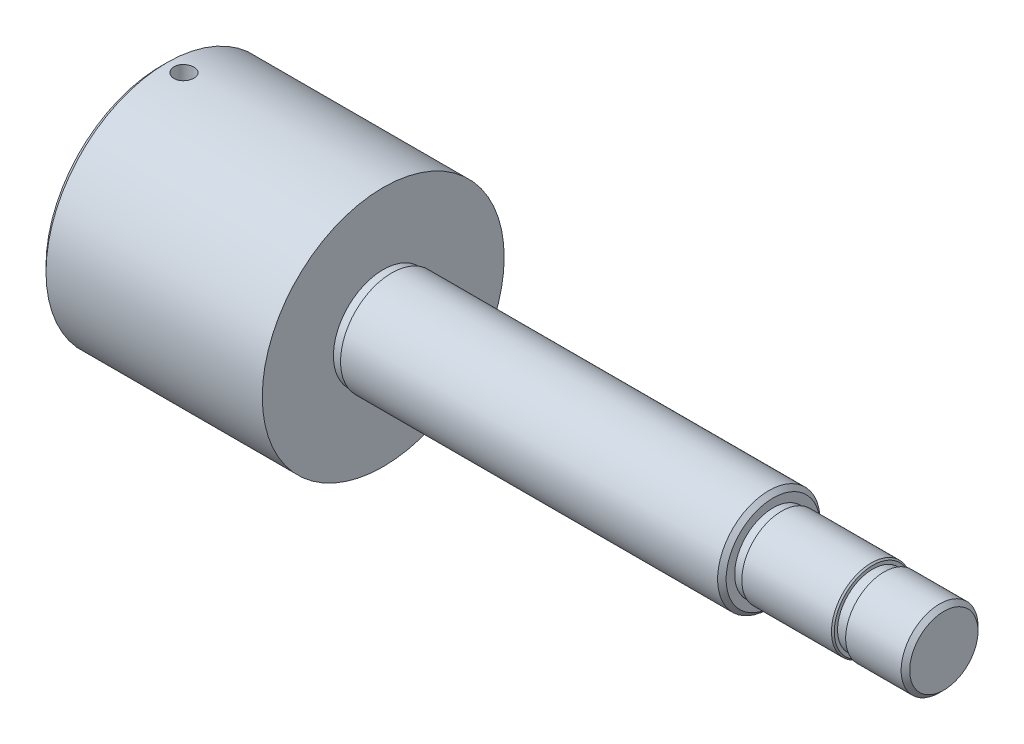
ISO-10303-21;
HEADER;
FILE_DESCRIPTION(('STEP AP214'),'2;1');
FILE_NAME('part.step','',(''),(''),'','','');
FILE_SCHEMA(('AUTOMOTIVE_DESIGN { 1 0 10303 214 1 1 1 1 }'));
ENDSEC;
DATA;
#1=APPLICATION_CONTEXT('core data for automotive mechanical design processes');
#2=APPLICATION_PROTOCOL_DEFINITION('international standard','automotive_design',2000,#1);
#3=PRODUCT_CONTEXT('',#1,'mechanical');
#4=PRODUCT('Part','Part','',(#3));
#5=PRODUCT_RELATED_PRODUCT_CATEGORY('part','',(#4));
#6=PRODUCT_DEFINITION_FORMATION('','',#4);
#7=PRODUCT_DEFINITION_CONTEXT('part definition',#1,'design');
#8=PRODUCT_DEFINITION('design','',#6,#7);
#9=PRODUCT_DEFINITION_SHAPE('','',#8);
#10=(LENGTH_UNIT() NAMED_UNIT(*) SI_UNIT(.MILLI.,.METRE.));
#11=(NAMED_UNIT(*) PLANE_ANGLE_UNIT() SI_UNIT($,.RADIAN.));
#12=(NAMED_UNIT(*) SI_UNIT($,.STERADIAN.) SOLID_ANGLE_UNIT());
#13=UNCERTAINTY_MEASURE_WITH_UNIT(LENGTH_MEASURE(1.E-05),#10,'distance_accuracy_value','');
#14=(GEOMETRIC_REPRESENTATION_CONTEXT(3) GLOBAL_UNCERTAINTY_ASSIGNED_CONTEXT((#13)) GLOBAL_UNIT_ASSIGNED_CONTEXT((#10,
#11,#12)) REPRESENTATION_CONTEXT('',''));
#15=CARTESIAN_POINT('',(0.,0.,0.));
#16=DIRECTION('',(0.,0.,1.));
#17=DIRECTION('',(1.,0.,0.));
#18=AXIS2_PLACEMENT_3D('',#15,#16,#17);
#19=CARTESIAN_POINT('',(0.,33.,0.));
#20=DIRECTION('',(-1.,0.,0.));
#21=DIRECTION('',(0.,0.,1.));
#22=AXIS2_PLACEMENT_3D('',#19,#20,#21);
#23=PLANE('',#22);
#24=CARTESIAN_POINT('',(0.,0.,0.));
#25=DIRECTION('',(-1.,0.,0.));
#26=DIRECTION('',(0.,0.,1.));
#27=AXIS2_PLACEMENT_3D('',#24,#25,#26);
#28=CIRCLE('',#27,40.5);
#29=CARTESIAN_POINT('',(0.,0.,40.5));
#30=VERTEX_POINT('',#29);
#31=EDGE_CURVE('E187',#30,#30,#28,.T.);
#32=ORIENTED_EDGE('',*,*,#31,.T.);
#33=EDGE_LOOP('',(#32));
#34=FACE_BOUND('',#33,.T.);
#35=CARTESIAN_POINT('',(0.,0.,0.));
#36=DIRECTION('',(-1.,0.,0.));
#37=DIRECTION('',(0.,0.,1.));
#38=AXIS2_PLACEMENT_3D('',#35,#36,#37);
#39=CIRCLE('',#38,35.0000000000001);
#40=CARTESIAN_POINT('',(0.,0.,35.0000000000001));
#41=VERTEX_POINT('',#40);
#42=EDGE_CURVE('E190',#41,#41,#39,.F.);
#43=ORIENTED_EDGE('',*,*,#42,.T.);
#44=EDGE_LOOP('',(#43));
#45=FACE_BOUND('',#44,.T.);
#46=ADVANCED_FACE('F39',(#34,#45),#23,.T.);
#47=CARTESIAN_POINT('',(0.,0.,0.));
#48=DIRECTION('',(1.,0.,0.));
#49=DIRECTION('',(0.,0.,-1.));
#50=AXIS2_PLACEMENT_3D('',#47,#48,#49);
#51=CYLINDRICAL_SURFACE('',#50,42.5);
#52=CARTESIAN_POINT('',(11.5,-42.5,0.));
#53=CARTESIAN_POINT('',(11.4999914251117,-42.499998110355,0.196239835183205));
#54=CARTESIAN_POINT('',(11.483440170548,-42.4986263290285,0.392613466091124));
#55=CARTESIAN_POINT('',(11.4176573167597,-42.4932859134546,0.779928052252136));
#56=CARTESIAN_POINT('',(11.368388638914,-42.4893143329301,0.970862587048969));
#57=CARTESIAN_POINT('',(11.2386048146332,-42.4792231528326,1.3416333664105));
#58=CARTESIAN_POINT('',(11.1581072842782,-42.4731047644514,1.5214758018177));
#59=CARTESIAN_POINT('',(10.9681821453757,-42.4594062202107,1.86505307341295));
#60=CARTESIAN_POINT('',(10.8587607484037,-42.4518263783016,2.02879135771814));
#61=CARTESIAN_POINT('',(10.613799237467,-42.4360344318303,2.33596377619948));
#62=CARTESIAN_POINT('',(10.4782019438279,-42.4278209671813,2.47935224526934));
#63=CARTESIAN_POINT('',(10.184858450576,-42.4116989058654,2.74136300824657));
#64=CARTESIAN_POINT('',(10.0271112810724,-42.4037903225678,2.85998421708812));
#65=CARTESIAN_POINT('',(9.69367012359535,-42.3891587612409,3.06924725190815));
#66=CARTESIAN_POINT('',(9.51795092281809,-42.3824374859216,3.15984903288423));
#67=CARTESIAN_POINT('',(9.15372948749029,-42.3709569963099,3.31024554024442));
#68=CARTESIAN_POINT('',(8.96522747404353,-42.3661977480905,3.37004079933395));
#69=CARTESIAN_POINT('',(8.58124815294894,-42.3591915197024,3.45699467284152));
#70=CARTESIAN_POINT('',(8.38578777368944,-42.3569388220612,3.48422757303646));
#71=CARTESIAN_POINT('',(7.99305833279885,-42.3551826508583,3.50551316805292));
#72=CARTESIAN_POINT('',(7.79578930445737,-42.3556791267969,3.49956647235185));
#73=CARTESIAN_POINT('',(7.40555123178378,-42.3593600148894,3.45472308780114));
#74=CARTESIAN_POINT('',(7.21257284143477,-42.3625378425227,3.41590711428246));
#75=CARTESIAN_POINT('',(6.83587956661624,-42.3712130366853,3.30655240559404));
#76=CARTESIAN_POINT('',(6.65216477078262,-42.3767104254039,3.23601336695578));
#77=CARTESIAN_POINT('',(6.29895633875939,-42.3894128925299,3.06512443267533));
#78=CARTESIAN_POINT('',(6.12948031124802,-42.3966200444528,2.9647383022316));
#79=CARTESIAN_POINT('',(5.80975278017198,-42.4119280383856,2.73703090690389));
#80=CARTESIAN_POINT('',(5.65950165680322,-42.4200288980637,2.60970910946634));
#81=CARTESIAN_POINT('',(5.38201967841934,-42.4362408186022,2.33129176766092));
#82=CARTESIAN_POINT('',(5.25485882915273,-42.44435183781,2.18012643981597));
#83=CARTESIAN_POINT('',(5.02770823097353,-42.4596471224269,1.85855658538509));
#84=CARTESIAN_POINT('',(4.92771849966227,-42.4668313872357,1.6881520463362));
#85=CARTESIAN_POINT('',(4.75775292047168,-42.4794650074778,1.33289558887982));
#86=CARTESIAN_POINT('',(4.68778014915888,-42.48491418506,1.14804219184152));
#87=CARTESIAN_POINT('',(4.57988365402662,-42.4934615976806,0.769156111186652));
#88=CARTESIAN_POINT('',(4.54195928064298,-42.4965598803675,0.575123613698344));
#89=CARTESIAN_POINT('',(4.49932383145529,-42.500050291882,0.183994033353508));
#90=CARTESIAN_POINT('',(4.49451605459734,-42.5004502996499,-0.0130924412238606));
#91=CARTESIAN_POINT('',(4.51799698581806,-42.4985201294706,-0.405268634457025));
#92=CARTESIAN_POINT('',(4.54628539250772,-42.4961899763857,-0.60035837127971));
#93=CARTESIAN_POINT('',(4.63507554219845,-42.4890666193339,-0.982727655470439));
#94=CARTESIAN_POINT('',(4.69553248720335,-42.4842768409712,-1.17001767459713));
#95=CARTESIAN_POINT('',(4.84689782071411,-42.4727723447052,-1.53179535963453));
#96=CARTESIAN_POINT('',(4.93780667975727,-42.466057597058,-1.70628282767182));
#97=CARTESIAN_POINT('',(5.14773845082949,-42.4514363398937,-2.03794256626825));
#98=CARTESIAN_POINT('',(5.26682545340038,-42.4435271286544,-2.19507414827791));
#99=CARTESIAN_POINT('',(5.52964044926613,-42.427414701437,-2.48715105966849));
#100=CARTESIAN_POINT('',(5.67336886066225,-42.4192114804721,-2.62209601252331));
#101=CARTESIAN_POINT('',(5.98180624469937,-42.403412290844,-2.86630055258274));
#102=CARTESIAN_POINT('',(6.14656525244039,-42.3958178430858,-2.975497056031));
#103=CARTESIAN_POINT('',(6.4921377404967,-42.3821174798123,-3.16467252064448));
#104=CARTESIAN_POINT('',(6.67295106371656,-42.3760115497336,-3.24465176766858));
#105=CARTESIAN_POINT('',(7.04527580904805,-42.3659880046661,-3.37301484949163));
#106=CARTESIAN_POINT('',(7.23677382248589,-42.3620677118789,-3.42143735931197));
#107=CARTESIAN_POINT('',(7.62521577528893,-42.3568502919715,-3.48543836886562));
#108=CARTESIAN_POINT('',(7.82215961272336,-42.3555531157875,-3.50101748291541));
#109=CARTESIAN_POINT('',(8.21527576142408,-42.355729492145,-3.49888244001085));
#110=CARTESIAN_POINT('',(8.41144862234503,-42.3571947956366,-3.48126740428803));
#111=CARTESIAN_POINT('',(8.79803974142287,-42.3627135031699,-3.41345071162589));
#112=CARTESIAN_POINT('',(8.98845799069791,-42.366766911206,-3.36324900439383));
#113=CARTESIAN_POINT('',(9.35814149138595,-42.3770029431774,-3.23170898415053));
#114=CARTESIAN_POINT('',(9.53740735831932,-42.3831854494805,-3.15037239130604));
#115=CARTESIAN_POINT('',(9.87975562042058,-42.3969832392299,-2.95888265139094));
#116=CARTESIAN_POINT('',(10.0428382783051,-42.4045984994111,-2.84872997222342));
#117=CARTESIAN_POINT('',(10.348697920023,-42.4204307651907,-2.60236259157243));
#118=CARTESIAN_POINT('',(10.4914157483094,-42.4286494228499,-2.46607455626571));
#119=CARTESIAN_POINT('',(10.752007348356,-42.4447473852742,-2.17143708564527));
#120=CARTESIAN_POINT('',(10.8698750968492,-42.452626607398,-2.01308231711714));
#121=CARTESIAN_POINT('',(11.0775747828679,-42.4671717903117,-1.67850814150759));
#122=CARTESIAN_POINT('',(11.1673550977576,-42.4738355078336,-1.50225661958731));
#123=CARTESIAN_POINT('',(11.3159329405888,-42.4851723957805,-1.13724643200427));
#124=CARTESIAN_POINT('',(11.3747661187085,-42.4898478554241,-0.948502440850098));
#125=CARTESIAN_POINT('',(11.4447795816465,-42.4954798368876,-0.632202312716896));
#126=CARTESIAN_POINT('',(11.4654597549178,-42.4971671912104,-0.506680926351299));
#127=CARTESIAN_POINT('',(11.493072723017,-42.4994278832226,-0.254125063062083));
#128=CARTESIAN_POINT('',(11.5000055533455,-42.5000012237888,-0.127090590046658));
#129=CARTESIAN_POINT('',(11.5,-42.5,0.));
#130=B_SPLINE_CURVE_WITH_KNOTS('',3,(#52,#53,#54,#55,#56,#57,#58,#59,#60,#61,#62,#63,#64,#65,
#66,#67,#68,#69,#70,#71,#72,#73,#74,#75,#76,#77,#78,#79,#80,#81,#82,#83,#84,#85,#86,#87,#88,#89,
#90,#91,#92,#93,#94,#95,#96,#97,#98,#99,#100,#101,#102,#103,#104,#105,#106,#107,#108,#109,#110,
#111,#112,#113,#114,#115,#116,#117,#118,#119,#120,#121,#122,#123,#124,#125,#126,#127,#128,#129),
.UNSPECIFIED.,.T.,.F.,(4,2,2,2,2,2,2,2,2,2,2,2,2,2,2,2,2,2,2,2,2,2,2,2,2,2,2,2,2,2,2,2,2,2,2,2,
2,2,4),(0.,0.5882554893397,1.17717878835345,1.76577035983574,2.35423563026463,2.94400121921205,
3.53379264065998,4.12442312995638,4.71504340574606,5.30431368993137,5.89357314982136,
6.48138977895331,7.06921203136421,7.65775084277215,8.24630129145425,8.83660736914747,
9.42691382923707,10.0172807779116,10.6076357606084,11.1962661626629,11.7848912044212,
12.3726986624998,12.9605152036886,13.5496817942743,14.1388583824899,14.7294637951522,
15.320063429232,15.909937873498,16.49980128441,17.0879060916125,17.6760118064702,
18.2640850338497,18.8521487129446,19.4418872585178,20.0317685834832,20.6227277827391,
21.2130047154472,21.5939769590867,21.9749482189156),.UNSPECIFIED.);
#131=CARTESIAN_POINT('',(11.5,-42.5,0.));
#132=VERTEX_POINT('',#131);
#133=EDGE_CURVE('E49',#132,#132,#130,.T.);
#134=ORIENTED_EDGE('',*,*,#133,.F.);
#135=EDGE_LOOP('',(#134));
#136=FACE_BOUND('',#135,.T.);
#137=CARTESIAN_POINT('',(11.5,42.5,0.));
#138=CARTESIAN_POINT('',(11.4999914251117,42.499998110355,-0.196239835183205));
#139=CARTESIAN_POINT('',(11.483440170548,42.4986263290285,-0.392613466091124));
#140=CARTESIAN_POINT('',(11.4176573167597,42.4932859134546,-0.779928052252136));
#141=CARTESIAN_POINT('',(11.368388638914,42.4893143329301,-0.970862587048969));
#142=CARTESIAN_POINT('',(11.2386048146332,42.4792231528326,-1.3416333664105));
#143=CARTESIAN_POINT('',(11.1581072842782,42.4731047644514,-1.5214758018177));
#144=CARTESIAN_POINT('',(10.9681821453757,42.4594062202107,-1.86505307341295));
#145=CARTESIAN_POINT('',(10.8587607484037,42.4518263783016,-2.02879135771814));
#146=CARTESIAN_POINT('',(10.613799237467,42.4360344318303,-2.33596377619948));
#147=CARTESIAN_POINT('',(10.4782019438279,42.4278209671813,-2.47935224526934));
#148=CARTESIAN_POINT('',(10.184858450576,42.4116989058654,-2.74136300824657));
#149=CARTESIAN_POINT('',(10.0271112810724,42.4037903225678,-2.85998421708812));
#150=CARTESIAN_POINT('',(9.69367012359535,42.3891587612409,-3.06924725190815));
#151=CARTESIAN_POINT('',(9.51795092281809,42.3824374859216,-3.15984903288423));
#152=CARTESIAN_POINT('',(9.15372948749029,42.3709569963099,-3.31024554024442));
#153=CARTESIAN_POINT('',(8.96522747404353,42.3661977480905,-3.37004079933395));
#154=CARTESIAN_POINT('',(8.58124815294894,42.3591915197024,-3.45699467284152));
#155=CARTESIAN_POINT('',(8.38578777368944,42.3569388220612,-3.48422757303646));
#156=CARTESIAN_POINT('',(7.99305833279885,42.3551826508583,-3.50551316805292));
#157=CARTESIAN_POINT('',(7.79578930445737,42.3556791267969,-3.49956647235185));
#158=CARTESIAN_POINT('',(7.40555123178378,42.3593600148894,-3.45472308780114));
#159=CARTESIAN_POINT('',(7.21257284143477,42.3625378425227,-3.41590711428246));
#160=CARTESIAN_POINT('',(6.83587956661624,42.3712130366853,-3.30655240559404));
#161=CARTESIAN_POINT('',(6.65216477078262,42.3767104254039,-3.23601336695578));
#162=CARTESIAN_POINT('',(6.29895633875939,42.3894128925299,-3.06512443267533));
#163=CARTESIAN_POINT('',(6.12948031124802,42.3966200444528,-2.9647383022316));
#164=CARTESIAN_POINT('',(5.80975278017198,42.4119280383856,-2.73703090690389));
#165=CARTESIAN_POINT('',(5.65950165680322,42.4200288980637,-2.60970910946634));
#166=CARTESIAN_POINT('',(5.38201967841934,42.4362408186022,-2.33129176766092));
#167=CARTESIAN_POINT('',(5.25485882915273,42.44435183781,-2.18012643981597));
#168=CARTESIAN_POINT('',(5.02770823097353,42.4596471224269,-1.85855658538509));
#169=CARTESIAN_POINT('',(4.92771849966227,42.4668313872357,-1.6881520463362));
#170=CARTESIAN_POINT('',(4.75775292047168,42.4794650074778,-1.33289558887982));
#171=CARTESIAN_POINT('',(4.68778014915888,42.48491418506,-1.14804219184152));
#172=CARTESIAN_POINT('',(4.57988365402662,42.4934615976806,-0.769156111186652));
#173=CARTESIAN_POINT('',(4.54195928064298,42.4965598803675,-0.575123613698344));
#174=CARTESIAN_POINT('',(4.49932383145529,42.500050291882,-0.183994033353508));
#175=CARTESIAN_POINT('',(4.49451605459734,42.5004502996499,0.0130924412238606));
#176=CARTESIAN_POINT('',(4.51799698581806,42.4985201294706,0.405268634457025));
#177=CARTESIAN_POINT('',(4.54628539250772,42.4961899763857,0.60035837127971));
#178=CARTESIAN_POINT('',(4.63507554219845,42.4890666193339,0.982727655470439));
#179=CARTESIAN_POINT('',(4.69553248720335,42.4842768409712,1.17001767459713));
#180=CARTESIAN_POINT('',(4.84689782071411,42.4727723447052,1.53179535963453));
#181=CARTESIAN_POINT('',(4.93780667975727,42.466057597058,1.70628282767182));
#182=CARTESIAN_POINT('',(5.14773845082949,42.4514363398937,2.03794256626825));
#183=CARTESIAN_POINT('',(5.26682545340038,42.4435271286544,2.19507414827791));
#184=CARTESIAN_POINT('',(5.52964044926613,42.427414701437,2.48715105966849));
#185=CARTESIAN_POINT('',(5.67336886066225,42.4192114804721,2.62209601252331));
#186=CARTESIAN_POINT('',(5.98180624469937,42.403412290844,2.86630055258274));
#187=CARTESIAN_POINT('',(6.14656525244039,42.3958178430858,2.975497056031));
#188=CARTESIAN_POINT('',(6.4921377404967,42.3821174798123,3.16467252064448));
#189=CARTESIAN_POINT('',(6.67295106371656,42.3760115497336,3.24465176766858));
#190=CARTESIAN_POINT('',(7.04527580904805,42.3659880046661,3.37301484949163));
#191=CARTESIAN_POINT('',(7.23677382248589,42.3620677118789,3.42143735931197));
#192=CARTESIAN_POINT('',(7.62521577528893,42.3568502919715,3.48543836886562));
#193=CARTESIAN_POINT('',(7.82215961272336,42.3555531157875,3.50101748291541));
#194=CARTESIAN_POINT('',(8.21527576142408,42.355729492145,3.49888244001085));
#195=CARTESIAN_POINT('',(8.41144862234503,42.3571947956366,3.48126740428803));
#196=CARTESIAN_POINT('',(8.79803974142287,42.3627135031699,3.41345071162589));
#197=CARTESIAN_POINT('',(8.98845799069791,42.366766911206,3.36324900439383));
#198=CARTESIAN_POINT('',(9.35814149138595,42.3770029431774,3.23170898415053));
#199=CARTESIAN_POINT('',(9.53740735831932,42.3831854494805,3.15037239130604));
#200=CARTESIAN_POINT('',(9.87975562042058,42.3969832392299,2.95888265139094));
#201=CARTESIAN_POINT('',(10.0428382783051,42.4045984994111,2.84872997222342));
#202=CARTESIAN_POINT('',(10.348697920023,42.4204307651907,2.60236259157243));
#203=CARTESIAN_POINT('',(10.4914157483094,42.4286494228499,2.46607455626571));
#204=CARTESIAN_POINT('',(10.752007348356,42.4447473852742,2.17143708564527));
#205=CARTESIAN_POINT('',(10.8698750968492,42.452626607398,2.01308231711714));
#206=CARTESIAN_POINT('',(11.0775747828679,42.4671717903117,1.67850814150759));
#207=CARTESIAN_POINT('',(11.1673550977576,42.4738355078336,1.50225661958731));
#208=CARTESIAN_POINT('',(11.3159329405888,42.4851723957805,1.13724643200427));
#209=CARTESIAN_POINT('',(11.3747661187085,42.4898478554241,0.948502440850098));
#210=CARTESIAN_POINT('',(11.4447795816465,42.4954798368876,0.632202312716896));
#211=CARTESIAN_POINT('',(11.4654597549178,42.4971671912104,0.506680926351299));
#212=CARTESIAN_POINT('',(11.493072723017,42.4994278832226,0.254125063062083));
#213=CARTESIAN_POINT('',(11.5000055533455,42.5000012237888,0.127090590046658));
#214=CARTESIAN_POINT('',(11.5,42.5,0.));
#215=B_SPLINE_CURVE_WITH_KNOTS('',3,(#137,#138,#139,#140,#141,#142,#143,#144,#145,#146,#147,
#148,#149,#150,#151,#152,#153,#154,#155,#156,#157,#158,#159,#160,#161,#162,#163,#164,#165,#166,
#167,#168,#169,#170,#171,#172,#173,#174,#175,#176,#177,#178,#179,#180,#181,#182,#183,#184,#185,
#186,#187,#188,#189,#190,#191,#192,#193,#194,#195,#196,#197,#198,#199,#200,#201,#202,#203,#204,
#205,#206,#207,#208,#209,#210,#211,#212,#213,#214),.UNSPECIFIED.,.T.,.F.,(4,2,2,2,2,2,2,2,2,2,2,
2,2,2,2,2,2,2,2,2,2,2,2,2,2,2,2,2,2,2,2,2,2,2,2,2,2,2,4),(0.,0.5882554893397,1.17717878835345,
1.76577035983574,2.35423563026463,2.94400121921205,3.53379264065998,4.12442312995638,
4.71504340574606,5.30431368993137,5.89357314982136,6.48138977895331,7.06921203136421,
7.65775084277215,8.24630129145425,8.83660736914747,9.42691382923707,10.0172807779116,
10.6076357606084,11.1962661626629,11.7848912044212,12.3726986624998,12.9605152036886,
13.5496817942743,14.1388583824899,14.7294637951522,15.320063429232,15.909937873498,
16.49980128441,17.0879060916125,17.6760118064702,18.2640850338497,18.8521487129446,
19.4418872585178,20.0317685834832,20.6227277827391,21.2130047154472,21.5939769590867,
21.9749482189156),.UNSPECIFIED.);
#216=CARTESIAN_POINT('',(11.5,42.5,0.));
#217=VERTEX_POINT('',#216);
#218=EDGE_CURVE('E53',#217,#217,#215,.T.);
#219=ORIENTED_EDGE('',*,*,#218,.F.);
#220=EDGE_LOOP('',(#219));
#221=FACE_BOUND('',#220,.T.);
#222=CARTESIAN_POINT('',(1.99999999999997,0.,0.));
#223=DIRECTION('',(-1.,0.,0.));
#224=DIRECTION('',(0.,0.,1.));
#225=AXIS2_PLACEMENT_3D('',#222,#223,#224);
#226=CIRCLE('',#225,42.5);
#227=CARTESIAN_POINT('',(1.99999999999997,0.,42.5));
#228=VERTEX_POINT('',#227);
#229=EDGE_CURVE('E213',#228,#228,#226,.F.);
#230=ORIENTED_EDGE('',*,*,#229,.T.);
#231=EDGE_LOOP('',(#230));
#232=FACE_BOUND('',#231,.T.);
#233=CARTESIAN_POINT('',(78.,0.,0.));
#234=DIRECTION('',(1.,0.,0.));
#235=DIRECTION('',(0.,0.,-1.));
#236=AXIS2_PLACEMENT_3D('',#233,#234,#235);
#237=CIRCLE('',#236,42.5);
#238=CARTESIAN_POINT('',(78.,0.,-42.5));
#239=VERTEX_POINT('',#238);
#240=EDGE_CURVE('E193',#239,#239,#237,.T.);
#241=ORIENTED_EDGE('',*,*,#240,.F.);
#242=EDGE_LOOP('',(#241));
#243=FACE_BOUND('',#242,.T.);
#244=ADVANCED_FACE('F63',(#136,#221,#232,#243),#51,.T.);
#245=CARTESIAN_POINT('',(78.,42.5,0.));
#246=DIRECTION('',(1.,0.,0.));
#247=DIRECTION('',(0.,0.,-1.));
#248=AXIS2_PLACEMENT_3D('',#245,#246,#247);
#249=PLANE('',#248);
#250=ORIENTED_EDGE('',*,*,#240,.T.);
#251=EDGE_LOOP('',(#250));
#252=FACE_BOUND('',#251,.T.);
#253=CARTESIAN_POINT('',(78.,0.,0.));
#254=DIRECTION('',(1.,0.,0.));
#255=DIRECTION('',(0.,0.,-1.));
#256=AXIS2_PLACEMENT_3D('',#253,#254,#255);
#257=CIRCLE('',#256,17.5);
#258=CARTESIAN_POINT('',(78.,0.,-17.5));
#259=VERTEX_POINT('',#258);
#260=EDGE_CURVE('E198',#259,#259,#257,.T.);
#261=ORIENTED_EDGE('',*,*,#260,.F.);
#262=EDGE_LOOP('',(#261));
#263=FACE_BOUND('',#262,.T.);
#264=ADVANCED_FACE('F168',(#252,#263),#249,.T.);
#265=CARTESIAN_POINT('',(0.,0.,0.));
#266=DIRECTION('',(1.,0.,0.));
#267=DIRECTION('',(0.,0.,-1.));
#268=AXIS2_PLACEMENT_3D('',#265,#266,#267);
#269=CYLINDRICAL_SURFACE('',#268,17.5);
#270=ORIENTED_EDGE('',*,*,#260,.T.);
#271=EDGE_LOOP('',(#270));
#272=FACE_BOUND('',#271,.T.);
#273=CARTESIAN_POINT('',(81.,0.,0.));
#274=DIRECTION('',(1.,0.,0.));
#275=DIRECTION('',(0.,0.,-1.));
#276=AXIS2_PLACEMENT_3D('',#273,#274,#275);
#277=CIRCLE('',#276,17.5);
#278=CARTESIAN_POINT('',(81.,0.,-17.5));
#279=VERTEX_POINT('',#278);
#280=EDGE_CURVE('E273',#279,#279,#277,.T.);
#281=ORIENTED_EDGE('',*,*,#280,.F.);
#282=EDGE_LOOP('',(#281));
#283=FACE_BOUND('',#282,.T.);
#284=ADVANCED_FACE('F165',(#272,#283),#269,.T.);
#285=CARTESIAN_POINT('',(81.,17.5,0.));
#286=DIRECTION('',(-1.,0.,0.));
#287=DIRECTION('',(0.,0.,1.));
#288=AXIS2_PLACEMENT_3D('',#285,#286,#287);
#289=PLANE('',#288);
#290=ORIENTED_EDGE('',*,*,#280,.T.);
#291=EDGE_LOOP('',(#290));
#292=FACE_BOUND('',#291,.T.);
#293=CARTESIAN_POINT('',(81.,0.,0.));
#294=DIRECTION('',(1.,0.,0.));
#295=DIRECTION('',(0.,0.,-1.));
#296=AXIS2_PLACEMENT_3D('',#293,#294,#295);
#297=CIRCLE('',#296,18.);
#298=CARTESIAN_POINT('',(81.,0.,-18.));
#299=VERTEX_POINT('',#298);
#300=EDGE_CURVE('E270',#299,#299,#297,.T.);
#301=ORIENTED_EDGE('',*,*,#300,.F.);
#302=EDGE_LOOP('',(#301));
#303=FACE_BOUND('',#302,.T.);
#304=ADVANCED_FACE('F161',(#292,#303),#289,.T.);
#305=CARTESIAN_POINT('',(0.,0.,0.));
#306=DIRECTION('',(1.,0.,0.));
#307=DIRECTION('',(0.,0.,-1.));
#308=AXIS2_PLACEMENT_3D('',#305,#306,#307);
#309=CYLINDRICAL_SURFACE('',#308,18.);
#310=CARTESIAN_POINT('',(213.5,0.,0.));
#311=DIRECTION('',(1.,0.,0.));
#312=DIRECTION('',(0.,0.,-1.));
#313=AXIS2_PLACEMENT_3D('',#310,#311,#312);
#314=CIRCLE('',#313,18.);
#315=CARTESIAN_POINT('',(213.5,0.,-18.));
#316=VERTEX_POINT('',#315);
#317=EDGE_CURVE('E210',#316,#316,#314,.F.);
#318=ORIENTED_EDGE('',*,*,#317,.T.);
#319=EDGE_LOOP('',(#318));
#320=FACE_BOUND('',#319,.T.);
#321=ORIENTED_EDGE('',*,*,#300,.T.);
#322=EDGE_LOOP('',(#321));
#323=FACE_BOUND('',#322,.T.);
#324=ADVANCED_FACE('F157',(#320,#323),#309,.T.);
#325=CARTESIAN_POINT('',(215.,14.,0.));
#326=DIRECTION('',(1.,0.,0.));
#327=DIRECTION('',(0.,0.,-1.));
#328=AXIS2_PLACEMENT_3D('',#325,#326,#327);
#329=PLANE('',#328);
#330=CARTESIAN_POINT('',(215.,0.,0.));
#331=DIRECTION('',(1.,0.,0.));
#332=DIRECTION('',(0.,0.,-1.));
#333=AXIS2_PLACEMENT_3D('',#330,#331,#332);
#334=CIRCLE('',#333,16.5);
#335=CARTESIAN_POINT('',(215.,0.,-16.5));
#336=VERTEX_POINT('',#335);
#337=EDGE_CURVE('E207',#336,#336,#334,.T.);
#338=ORIENTED_EDGE('',*,*,#337,.T.);
#339=EDGE_LOOP('',(#338));
#340=FACE_BOUND('',#339,.T.);
#341=CARTESIAN_POINT('',(215.,0.,0.));
#342=DIRECTION('',(1.,0.,0.));
#343=DIRECTION('',(0.,0.,-1.));
#344=AXIS2_PLACEMENT_3D('',#341,#342,#343);
#345=CIRCLE('',#344,13.5);
#346=CARTESIAN_POINT('',(215.,0.,-13.5));
#347=VERTEX_POINT('',#346);
#348=EDGE_CURVE('E267',#347,#347,#345,.T.);
#349=ORIENTED_EDGE('',*,*,#348,.F.);
#350=EDGE_LOOP('',(#349));
#351=FACE_BOUND('',#350,.T.);
#352=ADVANCED_FACE('F153',(#340,#351),#329,.T.);
#353=CARTESIAN_POINT('',(0.,0.,0.));
#354=DIRECTION('',(1.,0.,0.));
#355=DIRECTION('',(0.,0.,-1.));
#356=AXIS2_PLACEMENT_3D('',#353,#354,#355);
#357=CYLINDRICAL_SURFACE('',#356,13.5);
#358=ORIENTED_EDGE('',*,*,#348,.T.);
#359=EDGE_LOOP('',(#358));
#360=FACE_BOUND('',#359,.T.);
#361=CARTESIAN_POINT('',(218.,0.,0.));
#362=DIRECTION('',(1.,0.,0.));
#363=DIRECTION('',(0.,0.,-1.));
#364=AXIS2_PLACEMENT_3D('',#361,#362,#363);
#365=CIRCLE('',#364,13.5);
#366=CARTESIAN_POINT('',(218.,0.,-13.5));
#367=VERTEX_POINT('',#366);
#368=EDGE_CURVE('E264',#367,#367,#365,.T.);
#369=ORIENTED_EDGE('',*,*,#368,.F.);
#370=EDGE_LOOP('',(#369));
#371=FACE_BOUND('',#370,.T.);
#372=ADVANCED_FACE('F149',(#360,#371),#357,.T.);
#373=CARTESIAN_POINT('',(218.,13.5,0.));
#374=DIRECTION('',(-1.,0.,0.));
#375=DIRECTION('',(0.,0.,1.));
#376=AXIS2_PLACEMENT_3D('',#373,#374,#375);
#377=PLANE('',#376);
#378=ORIENTED_EDGE('',*,*,#368,.T.);
#379=EDGE_LOOP('',(#378));
#380=FACE_BOUND('',#379,.T.);
#381=CARTESIAN_POINT('',(218.,0.,0.));
#382=DIRECTION('',(1.,0.,0.));
#383=DIRECTION('',(0.,0.,-1.));
#384=AXIS2_PLACEMENT_3D('',#381,#382,#383);
#385=CIRCLE('',#384,14.);
#386=CARTESIAN_POINT('',(218.,0.,-14.));
#387=VERTEX_POINT('',#386);
#388=EDGE_CURVE('E261',#387,#387,#385,.T.);
#389=ORIENTED_EDGE('',*,*,#388,.F.);
#390=EDGE_LOOP('',(#389));
#391=FACE_BOUND('',#390,.T.);
#392=ADVANCED_FACE('F146',(#380,#391),#377,.T.);
#393=CARTESIAN_POINT('',(0.,0.,0.));
#394=DIRECTION('',(1.,0.,0.));
#395=DIRECTION('',(0.,0.,-1.));
#396=AXIS2_PLACEMENT_3D('',#393,#394,#395);
#397=CYLINDRICAL_SURFACE('',#396,14.);
#398=CARTESIAN_POINT('',(249.5,0.,0.));
#399=DIRECTION('',(1.,0.,0.));
#400=DIRECTION('',(0.,0.,-1.));
#401=AXIS2_PLACEMENT_3D('',#398,#399,#400);
#402=CIRCLE('',#401,14.);
#403=CARTESIAN_POINT('',(249.5,0.,-14.));
#404=VERTEX_POINT('',#403);
#405=EDGE_CURVE('E12',#404,#404,#402,.F.);
#406=ORIENTED_EDGE('',*,*,#405,.T.);
#407=EDGE_LOOP('',(#406));
#408=FACE_BOUND('',#407,.T.);
#409=ORIENTED_EDGE('',*,*,#388,.T.);
#410=EDGE_LOOP('',(#409));
#411=FACE_BOUND('',#410,.T.);
#412=ADVANCED_FACE('F143',(#408,#411),#397,.T.);
#413=CARTESIAN_POINT('',(250.,14.,0.));
#414=DIRECTION('',(1.,0.,0.));
#415=DIRECTION('',(0.,0.,-1.));
#416=AXIS2_PLACEMENT_3D('',#413,#414,#415);
#417=PLANE('',#416);
#418=CARTESIAN_POINT('',(250.,0.,0.));
#419=DIRECTION('',(1.,0.,0.));
#420=DIRECTION('',(0.,0.,-1.));
#421=AXIS2_PLACEMENT_3D('',#418,#419,#420);
#422=CIRCLE('',#421,13.5);
#423=CARTESIAN_POINT('',(250.,0.,-13.5));
#424=VERTEX_POINT('',#423);
#425=EDGE_CURVE('E45',#424,#424,#422,.T.);
#426=ORIENTED_EDGE('',*,*,#425,.T.);
#427=EDGE_LOOP('',(#426));
#428=FACE_BOUND('',#427,.T.);
#429=CARTESIAN_POINT('',(250.,0.,0.));
#430=DIRECTION('',(1.,0.,0.));
#431=DIRECTION('',(0.,0.,-1.));
#432=AXIS2_PLACEMENT_3D('',#429,#430,#431);
#433=CIRCLE('',#432,12.35);
#434=CARTESIAN_POINT('',(250.,0.,-12.35));
#435=VERTEX_POINT('',#434);
#436=EDGE_CURVE('E252',#435,#435,#433,.T.);
#437=ORIENTED_EDGE('',*,*,#436,.F.);
#438=EDGE_LOOP('',(#437));
#439=FACE_BOUND('',#438,.T.);
#440=ADVANCED_FACE('F139',(#428,#439),#417,.T.);
#441=CARTESIAN_POINT('',(0.,0.,0.));
#442=DIRECTION('',(1.,0.,0.));
#443=DIRECTION('',(0.,0.,-1.));
#444=AXIS2_PLACEMENT_3D('',#441,#442,#443);
#445=CYLINDRICAL_SURFACE('',#444,12.35);
#446=ORIENTED_EDGE('',*,*,#436,.T.);
#447=EDGE_LOOP('',(#446));
#448=FACE_BOUND('',#447,.T.);
#449=CARTESIAN_POINT('',(254.,0.,0.));
#450=DIRECTION('',(1.,0.,0.));
#451=DIRECTION('',(0.,0.,-1.));
#452=AXIS2_PLACEMENT_3D('',#449,#450,#451);
#453=CIRCLE('',#452,12.35);
#454=CARTESIAN_POINT('',(254.,0.,-12.35));
#455=VERTEX_POINT('',#454);
#456=EDGE_CURVE('E248',#455,#455,#453,.T.);
#457=ORIENTED_EDGE('',*,*,#456,.F.);
#458=EDGE_LOOP('',(#457));
#459=FACE_BOUND('',#458,.T.);
#460=ADVANCED_FACE('F135',(#448,#459),#445,.T.);
#461=CARTESIAN_POINT('',(254.,12.35,0.));
#462=DIRECTION('',(-1.,0.,0.));
#463=DIRECTION('',(0.,0.,1.));
#464=AXIS2_PLACEMENT_3D('',#461,#462,#463);
#465=PLANE('',#464);
#466=ORIENTED_EDGE('',*,*,#456,.T.);
#467=EDGE_LOOP('',(#466));
#468=FACE_BOUND('',#467,.T.);
#469=CARTESIAN_POINT('',(254.,0.,0.));
#470=DIRECTION('',(1.,0.,0.));
#471=DIRECTION('',(0.,0.,-1.));
#472=AXIS2_PLACEMENT_3D('',#469,#470,#471);
#473=CIRCLE('',#472,13.5);
#474=CARTESIAN_POINT('',(254.,0.,-13.5));
#475=VERTEX_POINT('',#474);
#476=EDGE_CURVE('E246',#475,#475,#473,.T.);
#477=ORIENTED_EDGE('',*,*,#476,.F.);
#478=EDGE_LOOP('',(#477));
#479=FACE_BOUND('',#478,.T.);
#480=ADVANCED_FACE('F131',(#468,#479),#465,.T.);
#481=CARTESIAN_POINT('',(0.,0.,0.));
#482=DIRECTION('',(1.,0.,0.));
#483=DIRECTION('',(0.,0.,-1.));
#484=AXIS2_PLACEMENT_3D('',#481,#482,#483);
#485=CYLINDRICAL_SURFACE('',#484,13.5);
#486=CARTESIAN_POINT('',(273.5,0.,0.));
#487=DIRECTION('',(1.,0.,0.));
#488=DIRECTION('',(0.,0.,-1.));
#489=AXIS2_PLACEMENT_3D('',#486,#487,#488);
#490=CIRCLE('',#489,13.5);
#491=CARTESIAN_POINT('',(273.5,0.,-13.5));
#492=VERTEX_POINT('',#491);
#493=EDGE_CURVE('E204',#492,#492,#490,.F.);
#494=ORIENTED_EDGE('',*,*,#493,.T.);
#495=EDGE_LOOP('',(#494));
#496=FACE_BOUND('',#495,.T.);
#497=ORIENTED_EDGE('',*,*,#476,.T.);
#498=EDGE_LOOP('',(#497));
#499=FACE_BOUND('',#498,.T.);
#500=ADVANCED_FACE('F127',(#496,#499),#485,.T.);
#501=CARTESIAN_POINT('',(275.,13.5,0.));
#502=DIRECTION('',(1.,0.,0.));
#503=DIRECTION('',(0.,0.,-1.));
#504=AXIS2_PLACEMENT_3D('',#501,#502,#503);
#505=PLANE('',#504);
#506=CARTESIAN_POINT('',(275.,0.,0.));
#507=DIRECTION('',(1.,0.,0.));
#508=DIRECTION('',(0.,0.,-1.));
#509=AXIS2_PLACEMENT_3D('',#506,#507,#508);
#510=CIRCLE('',#509,12.0000000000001);
#511=CARTESIAN_POINT('',(275.,0.,-12.0000000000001));
#512=VERTEX_POINT('',#511);
#513=EDGE_CURVE('E196',#512,#512,#510,.T.);
#514=ORIENTED_EDGE('',*,*,#513,.T.);
#515=EDGE_LOOP('',(#514));
#516=FACE_BOUND('',#515,.T.);
#517=ADVANCED_FACE('F123',(#516),#505,.T.);
#518=CARTESIAN_POINT('',(71.,22.5,0.));
#519=DIRECTION('',(-1.,0.,0.));
#520=DIRECTION('',(0.,0.,1.));
#521=AXIS2_PLACEMENT_3D('',#518,#519,#520);
#522=PLANE('',#521);
#523=CARTESIAN_POINT('',(71.,0.,0.));
#524=DIRECTION('',(1.,0.,0.));
#525=DIRECTION('',(0.,0.,-1.));
#526=AXIS2_PLACEMENT_3D('',#523,#524,#525);
#527=CIRCLE('',#526,22.5);
#528=CARTESIAN_POINT('',(71.,0.,-22.5));
#529=VERTEX_POINT('',#528);
#530=EDGE_CURVE('E249',#529,#529,#527,.T.);
#531=ORIENTED_EDGE('',*,*,#530,.F.);
#532=EDGE_LOOP('',(#531));
#533=FACE_BOUND('',#532,.T.);
#534=ADVANCED_FACE('F119',(#533),#522,.T.);
#535=CARTESIAN_POINT('',(0.,0.,0.));
#536=DIRECTION('',(1.,0.,0.));
#537=DIRECTION('',(0.,0.,-1.));
#538=AXIS2_PLACEMENT_3D('',#535,#536,#537);
#539=CYLINDRICAL_SURFACE('',#538,22.5);
#540=ORIENTED_EDGE('',*,*,#530,.T.);
#541=EDGE_LOOP('',(#540));
#542=FACE_BOUND('',#541,.T.);
#543=CARTESIAN_POINT('',(53.,0.,0.));
#544=DIRECTION('',(1.,0.,0.));
#545=DIRECTION('',(0.,0.,-1.));
#546=AXIS2_PLACEMENT_3D('',#543,#544,#545);
#547=CIRCLE('',#546,22.5);
#548=CARTESIAN_POINT('',(53.,0.,-22.5));
#549=VERTEX_POINT('',#548);
#550=EDGE_CURVE('E255',#549,#549,#547,.T.);
#551=ORIENTED_EDGE('',*,*,#550,.F.);
#552=EDGE_LOOP('',(#551));
#553=FACE_BOUND('',#552,.T.);
#554=ADVANCED_FACE('F115',(#542,#553),#539,.F.);
#555=CARTESIAN_POINT('',(53.,31.,0.));
#556=DIRECTION('',(-1.,0.,0.));
#557=DIRECTION('',(0.,0.,1.));
#558=AXIS2_PLACEMENT_3D('',#555,#556,#557);
#559=PLANE('',#558);
#560=ORIENTED_EDGE('',*,*,#550,.T.);
#561=EDGE_LOOP('',(#560));
#562=FACE_BOUND('',#561,.T.);
#563=CARTESIAN_POINT('',(53.,0.,0.));
#564=DIRECTION('',(1.,0.,0.));
#565=DIRECTION('',(0.,0.,-1.));
#566=AXIS2_PLACEMENT_3D('',#563,#564,#565);
#567=CIRCLE('',#566,31.);
#568=CARTESIAN_POINT('',(53.,0.,-31.));
#569=VERTEX_POINT('',#568);
#570=EDGE_CURVE('E295',#569,#569,#567,.T.);
#571=ORIENTED_EDGE('',*,*,#570,.F.);
#572=EDGE_LOOP('',(#571));
#573=FACE_BOUND('',#572,.T.);
#574=ADVANCED_FACE('F111',(#562,#573),#559,.T.);
#575=CARTESIAN_POINT('',(0.,0.,0.));
#576=DIRECTION('',(1.,0.,0.));
#577=DIRECTION('',(0.,0.,-1.));
#578=AXIS2_PLACEMENT_3D('',#575,#576,#577);
#579=CYLINDRICAL_SURFACE('',#578,31.);
#580=ORIENTED_EDGE('',*,*,#570,.T.);
#581=EDGE_LOOP('',(#580));
#582=FACE_BOUND('',#581,.T.);
#583=CARTESIAN_POINT('',(18.,0.,0.));
#584=DIRECTION('',(1.,0.,0.));
#585=DIRECTION('',(0.,0.,-1.));
#586=AXIS2_PLACEMENT_3D('',#583,#584,#585);
#587=CIRCLE('',#586,31.);
#588=CARTESIAN_POINT('',(18.,0.,-31.));
#589=VERTEX_POINT('',#588);
#590=EDGE_CURVE('E298',#589,#589,#587,.T.);
#591=ORIENTED_EDGE('',*,*,#590,.F.);
#592=EDGE_LOOP('',(#591));
#593=FACE_BOUND('',#592,.T.);
#594=ADVANCED_FACE('F107',(#582,#593),#579,.F.);
#595=CARTESIAN_POINT('',(18.,34.25,0.));
#596=DIRECTION('',(-1.,0.,0.));
#597=DIRECTION('',(0.,0.,1.));
#598=AXIS2_PLACEMENT_3D('',#595,#596,#597);
#599=PLANE('',#598);
#600=ORIENTED_EDGE('',*,*,#590,.T.);
#601=EDGE_LOOP('',(#600));
#602=FACE_BOUND('',#601,.T.);
#603=CARTESIAN_POINT('',(18.,0.,0.));
#604=DIRECTION('',(1.,0.,0.));
#605=DIRECTION('',(0.,0.,-1.));
#606=AXIS2_PLACEMENT_3D('',#603,#604,#605);
#607=CIRCLE('',#606,34.25);
#608=CARTESIAN_POINT('',(18.,0.,-34.25));
#609=VERTEX_POINT('',#608);
#610=EDGE_CURVE('E301',#609,#609,#607,.T.);
#611=ORIENTED_EDGE('',*,*,#610,.F.);
#612=EDGE_LOOP('',(#611));
#613=FACE_BOUND('',#612,.T.);
#614=ADVANCED_FACE('F103',(#602,#613),#599,.T.);
#615=CARTESIAN_POINT('',(0.,0.,0.));
#616=DIRECTION('',(1.,0.,0.));
#617=DIRECTION('',(0.,0.,-1.));
#618=AXIS2_PLACEMENT_3D('',#615,#616,#617);
#619=CYLINDRICAL_SURFACE('',#618,34.25);
#620=ORIENTED_EDGE('',*,*,#610,.T.);
#621=EDGE_LOOP('',(#620));
#622=FACE_BOUND('',#621,.T.);
#623=CARTESIAN_POINT('',(14.,0.,0.));
#624=DIRECTION('',(1.,0.,0.));
#625=DIRECTION('',(0.,0.,-1.));
#626=AXIS2_PLACEMENT_3D('',#623,#624,#625);
#627=CIRCLE('',#626,34.25);
#628=CARTESIAN_POINT('',(14.,0.,-34.25));
#629=VERTEX_POINT('',#628);
#630=EDGE_CURVE('E304',#629,#629,#627,.T.);
#631=ORIENTED_EDGE('',*,*,#630,.F.);
#632=EDGE_LOOP('',(#631));
#633=FACE_BOUND('',#632,.T.);
#634=ADVANCED_FACE('F99',(#622,#633),#619,.F.);
#635=CARTESIAN_POINT('',(14.,33.,0.));
#636=DIRECTION('',(1.,0.,0.));
#637=DIRECTION('',(0.,0.,-1.));
#638=AXIS2_PLACEMENT_3D('',#635,#636,#637);
#639=PLANE('',#638);
#640=ORIENTED_EDGE('',*,*,#630,.T.);
#641=EDGE_LOOP('',(#640));
#642=FACE_BOUND('',#641,.T.);
#643=CARTESIAN_POINT('',(14.,0.,0.));
#644=DIRECTION('',(1.,0.,0.));
#645=DIRECTION('',(0.,0.,-1.));
#646=AXIS2_PLACEMENT_3D('',#643,#644,#645);
#647=CIRCLE('',#646,33.);
#648=CARTESIAN_POINT('',(14.,0.,-33.));
#649=VERTEX_POINT('',#648);
#650=EDGE_CURVE('E306',#649,#649,#647,.T.);
#651=ORIENTED_EDGE('',*,*,#650,.F.);
#652=EDGE_LOOP('',(#651));
#653=FACE_BOUND('',#652,.T.);
#654=ADVANCED_FACE('F93',(#642,#653),#639,.T.);
#655=CARTESIAN_POINT('',(0.,0.,0.));
#656=DIRECTION('',(1.,0.,0.));
#657=DIRECTION('',(0.,0.,-1.));
#658=AXIS2_PLACEMENT_3D('',#655,#656,#657);
#659=CYLINDRICAL_SURFACE('',#658,33.);
#660=CARTESIAN_POINT('',(8.,-32.8138690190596,3.49999999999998));
#661=CARTESIAN_POINT('',(8.19600242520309,-32.8138714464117,3.49999154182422));
#662=CARTESIAN_POINT('',(8.39213287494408,-32.8156440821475,3.48348011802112));
#663=CARTESIAN_POINT('',(8.77895142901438,-32.8225417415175,3.41786480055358));
#664=CARTESIAN_POINT('',(8.96963336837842,-32.8276704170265,3.36872540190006));
#665=CARTESIAN_POINT('',(9.33989744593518,-32.8406928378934,3.23930512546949));
#666=CARTESIAN_POINT('',(9.5194864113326,-32.8485848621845,3.15904362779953));
#667=CARTESIAN_POINT('',(9.8626067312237,-32.866242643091,2.96969571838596));
#668=CARTESIAN_POINT('',(10.0261411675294,-32.8760080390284,2.86061485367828));
#669=CARTESIAN_POINT('',(10.3332137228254,-32.8963567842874,2.61624788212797));
#670=CARTESIAN_POINT('',(10.4766772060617,-32.9069429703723,2.48086821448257));
#671=CARTESIAN_POINT('',(10.7388922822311,-32.9277148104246,2.18794693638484));
#672=CARTESIAN_POINT('',(10.8576427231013,-32.9379004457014,2.03040429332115));
#673=CARTESIAN_POINT('',(11.0673213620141,-32.956751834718,1.69716875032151));
#674=CARTESIAN_POINT('',(11.1581831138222,-32.9654139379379,1.52143381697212));
#675=CARTESIAN_POINT('',(11.3090799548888,-32.9802113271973,1.15709346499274));
#676=CARTESIAN_POINT('',(11.3691158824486,-32.9863466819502,0.968488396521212));
#677=CARTESIAN_POINT('',(11.45643690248,-32.9953793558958,0.584518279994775));
#678=CARTESIAN_POINT('',(11.4838449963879,-32.9982888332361,0.389181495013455));
#679=CARTESIAN_POINT('',(11.5055130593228,-33.0005833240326,-0.00333959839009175));
#680=CARTESIAN_POINT('',(11.4997739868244,-32.9999684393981,-0.200523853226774));
#681=CARTESIAN_POINT('',(11.4554101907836,-32.9952934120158,-0.590307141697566));
#682=CARTESIAN_POINT('',(11.4169177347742,-32.9912471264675,-0.782921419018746));
#683=CARTESIAN_POINT('',(11.3083460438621,-32.9801798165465,-1.15894034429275));
#684=CARTESIAN_POINT('',(11.2382663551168,-32.9731587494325,-1.34234485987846));
#685=CARTESIAN_POINT('',(11.06836545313,-32.9569072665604,-1.69515335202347));
#686=CARTESIAN_POINT('',(10.9684859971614,-32.9476725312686,-1.86452907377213));
#687=CARTESIAN_POINT('',(10.7418630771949,-32.9280292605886,-2.18416373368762));
#688=CARTESIAN_POINT('',(10.615118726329,-32.9176206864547,-2.33442204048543));
#689=CARTESIAN_POINT('',(10.3376206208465,-32.8967366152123,-2.61233183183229));
#690=CARTESIAN_POINT('',(10.1867517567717,-32.8862610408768,-2.73986839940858));
#691=CARTESIAN_POINT('',(9.86568551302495,-32.8664746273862,-2.967823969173));
#692=CARTESIAN_POINT('',(9.69548809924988,-32.8571637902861,-3.06824292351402));
#693=CARTESIAN_POINT('',(9.34050459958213,-32.8407604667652,-3.23911376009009));
#694=CARTESIAN_POINT('',(9.15571484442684,-32.833668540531,-3.30955807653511));
#695=CARTESIAN_POINT('',(8.77683792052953,-32.8225174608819,-3.41838661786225));
#696=CARTESIAN_POINT('',(8.58275107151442,-32.8184582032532,-3.45677194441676));
#697=CARTESIAN_POINT('',(8.1917995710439,-32.8138503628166,-3.50024409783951));
#698=CARTESIAN_POINT('',(7.99495301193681,-32.8132848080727,-3.50549190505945));
#699=CARTESIAN_POINT('',(7.60318338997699,-32.8156836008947,-3.4829632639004));
#700=CARTESIAN_POINT('',(7.40826029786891,-32.8186478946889,-3.45518731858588));
#701=CARTESIAN_POINT('',(7.02634291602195,-32.8277569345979,-3.36753450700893));
#702=CARTESIAN_POINT('',(6.83933086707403,-32.8338940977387,-3.30773416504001));
#703=CARTESIAN_POINT('',(6.47799134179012,-32.8486512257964,-3.15780833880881));
#704=CARTESIAN_POINT('',(6.30366419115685,-32.8572712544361,-3.06768207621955));
#705=CARTESIAN_POINT('',(5.97191041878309,-32.876063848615,-2.85926115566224));
#706=CARTESIAN_POINT('',(5.81455099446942,-32.886242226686,-2.74086006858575));
#707=CARTESIAN_POINT('',(5.52188189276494,-32.9069858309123,-2.47940254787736));
#708=CARTESIAN_POINT('',(5.386572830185,-32.917551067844,-2.33634542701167));
#709=CARTESIAN_POINT('',(5.14128793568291,-32.9379293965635,-2.02893724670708));
#710=CARTESIAN_POINT('',(5.03141729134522,-32.9477392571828,-1.86450201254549));
#711=CARTESIAN_POINT('',(4.84085276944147,-32.9654542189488,-1.51941964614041));
#712=CARTESIAN_POINT('',(4.76015844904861,-32.9733593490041,-1.33877276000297));
#713=CARTESIAN_POINT('',(4.63041441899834,-32.9863596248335,-0.966758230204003));
#714=CARTESIAN_POINT('',(4.58130178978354,-32.9914603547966,-0.775412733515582));
#715=CARTESIAN_POINT('',(4.51591005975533,-32.9983000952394,-0.387134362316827));
#716=CARTESIAN_POINT('',(4.49962991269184,-33.0000392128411,-0.190201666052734));
#717=CARTESIAN_POINT('',(4.50038105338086,-32.9999596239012,0.202629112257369));
#718=CARTESIAN_POINT('',(4.51724929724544,-32.9981583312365,0.398527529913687));
#719=CARTESIAN_POINT('',(4.58347573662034,-32.9912347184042,0.784690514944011));
#720=CARTESIAN_POINT('',(4.63283394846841,-32.9861123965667,0.974955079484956));
#721=CARTESIAN_POINT('',(4.76259265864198,-32.973120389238,1.34444361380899));
#722=CARTESIAN_POINT('',(4.8429876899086,-32.9652511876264,1.52366952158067));
#723=CARTESIAN_POINT('',(5.03252075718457,-32.9476413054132,1.86610970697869));
#724=CARTESIAN_POINT('',(5.14165874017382,-32.9379006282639,2.02932401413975));
#725=CARTESIAN_POINT('',(5.38618966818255,-32.9175808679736,2.33594319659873));
#726=CARTESIAN_POINT('',(5.52170408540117,-32.906998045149,2.47925095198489));
#727=CARTESIAN_POINT('',(5.81489734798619,-32.8862180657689,2.74116223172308));
#728=CARTESIAN_POINT('',(5.97258148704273,-32.876021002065,2.8597598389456));
#729=CARTESIAN_POINT('',(6.3061327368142,-32.857136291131,3.069155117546));
#730=CARTESIAN_POINT('',(6.48204998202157,-32.8484529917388,3.15987326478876));
#731=CARTESIAN_POINT('',(6.84660376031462,-32.8336304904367,3.31035929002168));
#732=CARTESIAN_POINT('',(7.03522579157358,-32.8274884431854,3.3701618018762));
#733=CARTESIAN_POINT('',(7.35408032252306,-32.8199801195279,3.44233736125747));
#734=CARTESIAN_POINT('',(7.48227988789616,-32.8176994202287,3.46393096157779));
#735=CARTESIAN_POINT('',(7.74030090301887,-32.8146430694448,3.49276504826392));
#736=CARTESIAN_POINT('',(7.87012234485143,-32.8138674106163,3.50000560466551));
#737=CARTESIAN_POINT('',(8.,-32.8138690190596,3.49999999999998));
#738=B_SPLINE_CURVE_WITH_KNOTS('',3,(#660,#661,#662,#663,#664,#665,#666,#667,#668,#669,#670,
#671,#672,#673,#674,#675,#676,#677,#678,#679,#680,#681,#682,#683,#684,#685,#686,#687,#688,#689,
#690,#691,#692,#693,#694,#695,#696,#697,#698,#699,#700,#701,#702,#703,#704,#705,#706,#707,#708,
#709,#710,#711,#712,#713,#714,#715,#716,#717,#718,#719,#720,#721,#722,#723,#724,#725,#726,#727,
#728,#729,#730,#731,#732,#733,#734,#735,#736,#737),.UNSPECIFIED.,.T.,.F.,(4,2,2,2,2,2,2,2,2,2,2,
2,2,2,2,2,2,2,2,2,2,2,2,2,2,2,2,2,2,2,2,2,2,2,2,2,2,2,4),(0.,0.587532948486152,1.17570628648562,
1.76351394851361,2.35120855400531,2.94103355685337,3.53088604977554,4.12213317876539,
4.71336422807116,5.30235930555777,5.89133735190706,6.47794816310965,7.06456740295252,
7.65234076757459,8.24013353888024,8.83081957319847,9.42150664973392,10.0123427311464,
10.6031585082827,11.1911019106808,11.7790363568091,12.3655721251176,12.9521229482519,
13.5409174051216,14.1297282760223,14.720932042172,15.3121268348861,15.9021401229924,
16.4921346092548,17.079234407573,17.6663345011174,18.2533312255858,18.8403268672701,
19.430092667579,20.0199995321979,20.6115737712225,21.202483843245,21.5918044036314,
21.9811230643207),.UNSPECIFIED.);
#739=CARTESIAN_POINT('',(8.,-32.8138690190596,3.49999999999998));
#740=VERTEX_POINT('',#739);
#741=EDGE_CURVE('E77',#740,#740,#738,.T.);
#742=ORIENTED_EDGE('',*,*,#741,.F.);
#743=EDGE_LOOP('',(#742));
#744=FACE_BOUND('',#743,.T.);
#745=CARTESIAN_POINT('',(8.,32.8138690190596,-3.49999999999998));
#746=CARTESIAN_POINT('',(8.19600242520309,32.8138714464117,-3.49999154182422));
#747=CARTESIAN_POINT('',(8.39213287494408,32.8156440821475,-3.48348011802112));
#748=CARTESIAN_POINT('',(8.77895142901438,32.8225417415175,-3.41786480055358));
#749=CARTESIAN_POINT('',(8.96963336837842,32.8276704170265,-3.36872540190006));
#750=CARTESIAN_POINT('',(9.33989744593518,32.8406928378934,-3.23930512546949));
#751=CARTESIAN_POINT('',(9.5194864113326,32.8485848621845,-3.15904362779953));
#752=CARTESIAN_POINT('',(9.8626067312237,32.866242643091,-2.96969571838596));
#753=CARTESIAN_POINT('',(10.0261411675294,32.8760080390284,-2.86061485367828));
#754=CARTESIAN_POINT('',(10.3332137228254,32.8963567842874,-2.61624788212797));
#755=CARTESIAN_POINT('',(10.4766772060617,32.9069429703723,-2.48086821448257));
#756=CARTESIAN_POINT('',(10.7388922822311,32.9277148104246,-2.18794693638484));
#757=CARTESIAN_POINT('',(10.8576427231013,32.9379004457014,-2.03040429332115));
#758=CARTESIAN_POINT('',(11.0673213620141,32.956751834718,-1.69716875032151));
#759=CARTESIAN_POINT('',(11.1581831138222,32.9654139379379,-1.52143381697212));
#760=CARTESIAN_POINT('',(11.3090799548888,32.9802113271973,-1.15709346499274));
#761=CARTESIAN_POINT('',(11.3691158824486,32.9863466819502,-0.968488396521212));
#762=CARTESIAN_POINT('',(11.45643690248,32.9953793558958,-0.584518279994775));
#763=CARTESIAN_POINT('',(11.4838449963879,32.9982888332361,-0.389181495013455));
#764=CARTESIAN_POINT('',(11.5055130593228,33.0005833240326,0.00333959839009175));
#765=CARTESIAN_POINT('',(11.4997739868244,32.9999684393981,0.200523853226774));
#766=CARTESIAN_POINT('',(11.4554101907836,32.9952934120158,0.590307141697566));
#767=CARTESIAN_POINT('',(11.4169177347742,32.9912471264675,0.782921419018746));
#768=CARTESIAN_POINT('',(11.3083460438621,32.9801798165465,1.15894034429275));
#769=CARTESIAN_POINT('',(11.2382663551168,32.9731587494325,1.34234485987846));
#770=CARTESIAN_POINT('',(11.06836545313,32.9569072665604,1.69515335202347));
#771=CARTESIAN_POINT('',(10.9684859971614,32.9476725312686,1.86452907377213));
#772=CARTESIAN_POINT('',(10.7418630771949,32.9280292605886,2.18416373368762));
#773=CARTESIAN_POINT('',(10.615118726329,32.9176206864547,2.33442204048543));
#774=CARTESIAN_POINT('',(10.3376206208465,32.8967366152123,2.61233183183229));
#775=CARTESIAN_POINT('',(10.1867517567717,32.8862610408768,2.73986839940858));
#776=CARTESIAN_POINT('',(9.86568551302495,32.8664746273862,2.967823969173));
#777=CARTESIAN_POINT('',(9.69548809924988,32.8571637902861,3.06824292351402));
#778=CARTESIAN_POINT('',(9.34050459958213,32.8407604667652,3.23911376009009));
#779=CARTESIAN_POINT('',(9.15571484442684,32.833668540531,3.30955807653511));
#780=CARTESIAN_POINT('',(8.77683792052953,32.8225174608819,3.41838661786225));
#781=CARTESIAN_POINT('',(8.58275107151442,32.8184582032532,3.45677194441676));
#782=CARTESIAN_POINT('',(8.1917995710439,32.8138503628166,3.50024409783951));
#783=CARTESIAN_POINT('',(7.99495301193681,32.8132848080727,3.50549190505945));
#784=CARTESIAN_POINT('',(7.60318338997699,32.8156836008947,3.4829632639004));
#785=CARTESIAN_POINT('',(7.40826029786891,32.8186478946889,3.45518731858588));
#786=CARTESIAN_POINT('',(7.02634291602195,32.8277569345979,3.36753450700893));
#787=CARTESIAN_POINT('',(6.83933086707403,32.8338940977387,3.30773416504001));
#788=CARTESIAN_POINT('',(6.47799134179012,32.8486512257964,3.15780833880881));
#789=CARTESIAN_POINT('',(6.30366419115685,32.8572712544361,3.06768207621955));
#790=CARTESIAN_POINT('',(5.97191041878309,32.876063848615,2.85926115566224));
#791=CARTESIAN_POINT('',(5.81455099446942,32.886242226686,2.74086006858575));
#792=CARTESIAN_POINT('',(5.52188189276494,32.9069858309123,2.47940254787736));
#793=CARTESIAN_POINT('',(5.386572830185,32.917551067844,2.33634542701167));
#794=CARTESIAN_POINT('',(5.14128793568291,32.9379293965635,2.02893724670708));
#795=CARTESIAN_POINT('',(5.03141729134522,32.9477392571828,1.86450201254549));
#796=CARTESIAN_POINT('',(4.84085276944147,32.9654542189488,1.51941964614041));
#797=CARTESIAN_POINT('',(4.76015844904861,32.9733593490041,1.33877276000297));
#798=CARTESIAN_POINT('',(4.63041441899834,32.9863596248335,0.966758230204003));
#799=CARTESIAN_POINT('',(4.58130178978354,32.9914603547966,0.775412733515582));
#800=CARTESIAN_POINT('',(4.51591005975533,32.9983000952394,0.387134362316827));
#801=CARTESIAN_POINT('',(4.49962991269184,33.0000392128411,0.190201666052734));
#802=CARTESIAN_POINT('',(4.50038105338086,32.9999596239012,-0.202629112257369));
#803=CARTESIAN_POINT('',(4.51724929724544,32.9981583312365,-0.398527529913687));
#804=CARTESIAN_POINT('',(4.58347573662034,32.9912347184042,-0.784690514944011));
#805=CARTESIAN_POINT('',(4.63283394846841,32.9861123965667,-0.974955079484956));
#806=CARTESIAN_POINT('',(4.76259265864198,32.973120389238,-1.34444361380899));
#807=CARTESIAN_POINT('',(4.8429876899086,32.9652511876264,-1.52366952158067));
#808=CARTESIAN_POINT('',(5.03252075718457,32.9476413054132,-1.86610970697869));
#809=CARTESIAN_POINT('',(5.14165874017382,32.9379006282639,-2.02932401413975));
#810=CARTESIAN_POINT('',(5.38618966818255,32.9175808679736,-2.33594319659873));
#811=CARTESIAN_POINT('',(5.52170408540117,32.906998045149,-2.47925095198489));
#812=CARTESIAN_POINT('',(5.81489734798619,32.8862180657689,-2.74116223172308));
#813=CARTESIAN_POINT('',(5.97258148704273,32.876021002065,-2.8597598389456));
#814=CARTESIAN_POINT('',(6.3061327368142,32.857136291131,-3.069155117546));
#815=CARTESIAN_POINT('',(6.48204998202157,32.8484529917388,-3.15987326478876));
#816=CARTESIAN_POINT('',(6.84660376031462,32.8336304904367,-3.31035929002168));
#817=CARTESIAN_POINT('',(7.03522579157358,32.8274884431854,-3.3701618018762));
#818=CARTESIAN_POINT('',(7.35408032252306,32.8199801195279,-3.44233736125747));
#819=CARTESIAN_POINT('',(7.48227988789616,32.8176994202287,-3.46393096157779));
#820=CARTESIAN_POINT('',(7.74030090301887,32.8146430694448,-3.49276504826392));
#821=CARTESIAN_POINT('',(7.87012234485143,32.8138674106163,-3.50000560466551));
#822=CARTESIAN_POINT('',(8.,32.8138690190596,-3.49999999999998));
#823=B_SPLINE_CURVE_WITH_KNOTS('',3,(#745,#746,#747,#748,#749,#750,#751,#752,#753,#754,#755,
#756,#757,#758,#759,#760,#761,#762,#763,#764,#765,#766,#767,#768,#769,#770,#771,#772,#773,#774,
#775,#776,#777,#778,#779,#780,#781,#782,#783,#784,#785,#786,#787,#788,#789,#790,#791,#792,#793,
#794,#795,#796,#797,#798,#799,#800,#801,#802,#803,#804,#805,#806,#807,#808,#809,#810,#811,#812,
#813,#814,#815,#816,#817,#818,#819,#820,#821,#822),.UNSPECIFIED.,.T.,.F.,(4,2,2,2,2,2,2,2,2,2,2,
2,2,2,2,2,2,2,2,2,2,2,2,2,2,2,2,2,2,2,2,2,2,2,2,2,2,2,4),(0.,0.587532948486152,1.17570628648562,
1.76351394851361,2.35120855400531,2.94103355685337,3.53088604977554,4.12213317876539,
4.71336422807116,5.30235930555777,5.89133735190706,6.47794816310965,7.06456740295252,
7.65234076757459,8.24013353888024,8.83081957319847,9.42150664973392,10.0123427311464,
10.6031585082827,11.1911019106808,11.7790363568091,12.3655721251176,12.9521229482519,
13.5409174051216,14.1297282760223,14.720932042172,15.3121268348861,15.9021401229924,
16.4921346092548,17.079234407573,17.6663345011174,18.2533312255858,18.8403268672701,
19.430092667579,20.0199995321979,20.6115737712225,21.202483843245,21.5918044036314,
21.9811230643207),.UNSPECIFIED.);
#824=CARTESIAN_POINT('',(8.,32.8138690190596,-3.49999999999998));
#825=VERTEX_POINT('',#824);
#826=EDGE_CURVE('E83',#825,#825,#823,.T.);
#827=ORIENTED_EDGE('',*,*,#826,.F.);
#828=EDGE_LOOP('',(#827));
#829=FACE_BOUND('',#828,.T.);
#830=CARTESIAN_POINT('',(2.00000000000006,0.,0.));
#831=DIRECTION('',(-1.,0.,0.));
#832=DIRECTION('',(0.,0.,1.));
#833=AXIS2_PLACEMENT_3D('',#830,#831,#832);
#834=CIRCLE('',#833,33.);
#835=CARTESIAN_POINT('',(2.00000000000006,0.,33.));
#836=VERTEX_POINT('',#835);
#837=EDGE_CURVE('E192',#836,#836,#834,.T.);
#838=ORIENTED_EDGE('',*,*,#837,.T.);
#839=EDGE_LOOP('',(#838));
#840=FACE_BOUND('',#839,.T.);
#841=ORIENTED_EDGE('',*,*,#650,.T.);
#842=EDGE_LOOP('',(#841));
#843=FACE_BOUND('',#842,.T.);
#844=ADVANCED_FACE('F87',(#744,#829,#840,#843),#659,.F.);
#845=CARTESIAN_POINT('',(0.,0.,0.));
#846=DIRECTION('',(-1.,0.,0.));
#847=DIRECTION('',(0.,0.,1.));
#848=AXIS2_PLACEMENT_3D('',#845,#846,#847);
#849=CONICAL_SURFACE('',#848,35.0000000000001,0.785398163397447);
#850=ORIENTED_EDGE('',*,*,#837,.F.);
#851=EDGE_LOOP('',(#850));
#852=FACE_BOUND('',#851,.T.);
#853=ORIENTED_EDGE('',*,*,#42,.F.);
#854=EDGE_LOOP('',(#853));
#855=FACE_BOUND('',#854,.T.);
#856=ADVANCED_FACE('F92',(#852,#855),#849,.F.);
#857=CARTESIAN_POINT('',(275.,0.,0.));
#858=DIRECTION('',(-1.,0.,0.));
#859=DIRECTION('',(0.,0.,1.));
#860=AXIS2_PLACEMENT_3D('',#857,#858,#859);
#861=CONICAL_SURFACE('',#860,12.0000000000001,0.785398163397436);
#862=ORIENTED_EDGE('',*,*,#493,.F.);
#863=EDGE_LOOP('',(#862));
#864=FACE_BOUND('',#863,.T.);
#865=ORIENTED_EDGE('',*,*,#513,.F.);
#866=EDGE_LOOP('',(#865));
#867=FACE_BOUND('',#866,.T.);
#868=ADVANCED_FACE('F231',(#864,#867),#861,.T.);
#869=CARTESIAN_POINT('',(215.,0.,0.));
#870=DIRECTION('',(-1.,0.,0.));
#871=DIRECTION('',(0.,0.,1.));
#872=AXIS2_PLACEMENT_3D('',#869,#870,#871);
#873=CONICAL_SURFACE('',#872,16.5,0.785398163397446);
#874=ORIENTED_EDGE('',*,*,#317,.F.);
#875=EDGE_LOOP('',(#874));
#876=FACE_BOUND('',#875,.T.);
#877=ORIENTED_EDGE('',*,*,#337,.F.);
#878=EDGE_LOOP('',(#877));
#879=FACE_BOUND('',#878,.T.);
#880=ADVANCED_FACE('F225',(#876,#879),#873,.T.);
#881=CARTESIAN_POINT('',(1.99999999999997,0.,0.));
#882=DIRECTION('',(1.,0.,0.));
#883=DIRECTION('',(0.,0.,-1.));
#884=AXIS2_PLACEMENT_3D('',#881,#882,#883);
#885=CONICAL_SURFACE('',#884,42.5,0.785398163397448);
#886=ORIENTED_EDGE('',*,*,#31,.F.);
#887=EDGE_LOOP('',(#886));
#888=FACE_BOUND('',#887,.T.);
#889=ORIENTED_EDGE('',*,*,#229,.F.);
#890=EDGE_LOOP('',(#889));
#891=FACE_BOUND('',#890,.T.);
#892=ADVANCED_FACE('F224',(#888,#891),#885,.T.);
#893=CARTESIAN_POINT('',(8.,0.,0.));
#894=DIRECTION('',(0.,-1.,0.));
#895=DIRECTION('',(0.,0.,-1.));
#896=AXIS2_PLACEMENT_3D('',#893,#894,#895);
#897=CYLINDRICAL_SURFACE('',#896,3.49999999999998);
#898=ORIENTED_EDGE('',*,*,#826,.T.);
#899=EDGE_LOOP('',(#898));
#900=FACE_BOUND('',#899,.T.);
#901=ORIENTED_EDGE('',*,*,#218,.T.);
#902=EDGE_LOOP('',(#901));
#903=FACE_BOUND('',#902,.T.);
#904=ADVANCED_FACE('F71',(#900,#903),#897,.F.);
#905=CARTESIAN_POINT('',(8.,0.,0.));
#906=DIRECTION('',(0.,1.,0.));
#907=DIRECTION('',(0.,0.,1.));
#908=AXIS2_PLACEMENT_3D('',#905,#906,#907);
#909=CYLINDRICAL_SURFACE('',#908,3.49999999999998);
#910=ORIENTED_EDGE('',*,*,#741,.T.);
#911=EDGE_LOOP('',(#910));
#912=FACE_BOUND('',#911,.T.);
#913=ORIENTED_EDGE('',*,*,#133,.T.);
#914=EDGE_LOOP('',(#913));
#915=FACE_BOUND('',#914,.T.);
#916=ADVANCED_FACE('F66',(#912,#915),#909,.F.);
#917=CARTESIAN_POINT('',(250.,0.,0.));
#918=DIRECTION('',(-1.,0.,0.));
#919=DIRECTION('',(0.,0.,1.));
#920=AXIS2_PLACEMENT_3D('',#917,#918,#919);
#921=CONICAL_SURFACE('',#920,13.5,0.785398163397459);
#922=ORIENTED_EDGE('',*,*,#405,.F.);
#923=EDGE_LOOP('',(#922));
#924=FACE_BOUND('',#923,.T.);
#925=ORIENTED_EDGE('',*,*,#425,.F.);
#926=EDGE_LOOP('',(#925));
#927=FACE_BOUND('',#926,.T.);
#928=ADVANCED_FACE('F70',(#924,#927),#921,.T.);
#929=CLOSED_SHELL('',(#46,#244,#264,#284,#304,#324,#352,#372,#392,#412,#440,#460,#480,#500,#517,
#534,#554,#574,#594,#614,#634,#654,#844,#856,#868,#880,#892,#904,#916,#928));
#930=MANIFOLD_SOLID_BREP('B2',#929);
#931=ADVANCED_BREP_SHAPE_REPRESENTATION('',(#18,#930),#14);
#932=SHAPE_DEFINITION_REPRESENTATION(#9,#931);
ENDSEC;
END-ISO-10303-21;
